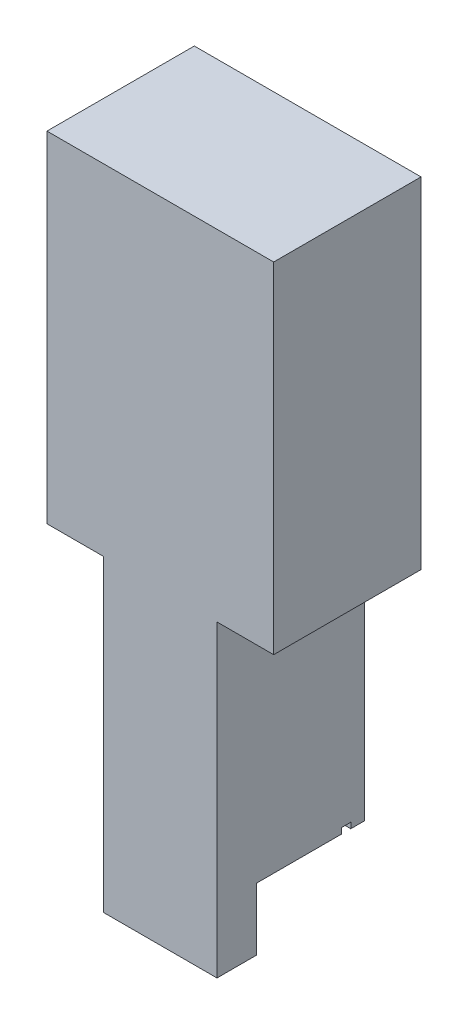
ISO-10303-21;
HEADER;
FILE_DESCRIPTION(('STEP AP214'),'2;1');
FILE_NAME('part.step','',(''),(''),'','','');
FILE_SCHEMA(('AUTOMOTIVE_DESIGN { 1 0 10303 214 1 1 1 1 }'));
ENDSEC;
DATA;
#1=APPLICATION_CONTEXT('core data for automotive mechanical design processes');
#2=APPLICATION_PROTOCOL_DEFINITION('international standard','automotive_design',2000,#1);
#3=PRODUCT_CONTEXT('',#1,'mechanical');
#4=PRODUCT('Part','Part','',(#3));
#5=PRODUCT_RELATED_PRODUCT_CATEGORY('part','',(#4));
#6=PRODUCT_DEFINITION_FORMATION('','',#4);
#7=PRODUCT_DEFINITION_CONTEXT('part definition',#1,'design');
#8=PRODUCT_DEFINITION('design','',#6,#7);
#9=PRODUCT_DEFINITION_SHAPE('','',#8);
#10=(LENGTH_UNIT() NAMED_UNIT(*) SI_UNIT(.MILLI.,.METRE.));
#11=(NAMED_UNIT(*) PLANE_ANGLE_UNIT() SI_UNIT($,.RADIAN.));
#12=(NAMED_UNIT(*) SI_UNIT($,.STERADIAN.) SOLID_ANGLE_UNIT());
#13=UNCERTAINTY_MEASURE_WITH_UNIT(LENGTH_MEASURE(1.E-05),#10,'distance_accuracy_value','');
#14=(GEOMETRIC_REPRESENTATION_CONTEXT(3) GLOBAL_UNCERTAINTY_ASSIGNED_CONTEXT((#13)) GLOBAL_UNIT_ASSIGNED_CONTEXT((#10,
#11,#12)) REPRESENTATION_CONTEXT('',''));
#15=CARTESIAN_POINT('',(0.,0.,0.));
#16=DIRECTION('',(0.,0.,1.));
#17=DIRECTION('',(1.,0.,0.));
#18=AXIS2_PLACEMENT_3D('',#15,#16,#17);
#19=CARTESIAN_POINT('',(5.,1.13686837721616E-13,13.));
#20=DIRECTION('',(1.,0.,0.));
#21=DIRECTION('',(0.,0.,-1.));
#22=AXIS2_PLACEMENT_3D('',#19,#20,#21);
#23=PLANE('',#22);
#24=DIRECTION('',(0.,0.,-1.));
#25=VECTOR('',#24,1.);
#26=CARTESIAN_POINT('',(5.,5.49999999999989,13.));
#27=LINE('',#26,#25);
#28=CARTESIAN_POINT('',(5.,5.49999999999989,1.20000000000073));
#29=VERTEX_POINT('',#28);
#30=CARTESIAN_POINT('',(5.,5.49999999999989,0.));
#31=VERTEX_POINT('',#30);
#32=EDGE_CURVE('E48',#29,#31,#27,.T.);
#33=ORIENTED_EDGE('',*,*,#32,.F.);
#34=DIRECTION('',(0.,-1.,0.));
#35=VECTOR('',#34,1.);
#36=CARTESIAN_POINT('',(5.,1.13686837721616E-13,1.20000000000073));
#37=LINE('',#36,#35);
#38=CARTESIAN_POINT('',(5.,5.99999999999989,1.20000000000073));
#39=VERTEX_POINT('',#38);
#40=EDGE_CURVE('E140',#39,#29,#37,.T.);
#41=ORIENTED_EDGE('',*,*,#40,.F.);
#42=DIRECTION('',(0.,0.,-1.));
#43=VECTOR('',#42,1.);
#44=CARTESIAN_POINT('',(5.,5.99999999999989,13.));
#45=LINE('',#44,#43);
#46=CARTESIAN_POINT('',(5.,5.99999999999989,2.));
#47=VERTEX_POINT('',#46);
#48=EDGE_CURVE('E243',#47,#39,#45,.T.);
#49=ORIENTED_EDGE('',*,*,#48,.F.);
#50=DIRECTION('',(0.,1.,0.));
#51=VECTOR('',#50,1.);
#52=CARTESIAN_POINT('',(5.,1.13686837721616E-13,2.));
#53=LINE('',#52,#51);
#54=CARTESIAN_POINT('',(5.,5.49999999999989,2.));
#55=VERTEX_POINT('',#54);
#56=EDGE_CURVE('E202',#55,#47,#53,.T.);
#57=ORIENTED_EDGE('',*,*,#56,.F.);
#58=DIRECTION('',(0.,0.,-1.));
#59=VECTOR('',#58,1.);
#60=CARTESIAN_POINT('',(5.,5.49999999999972,13.0000000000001));
#61=LINE('',#60,#59);
#62=CARTESIAN_POINT('',(5.,5.49999999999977,9.5));
#63=VERTEX_POINT('',#62);
#64=EDGE_CURVE('E240',#63,#55,#61,.T.);
#65=ORIENTED_EDGE('',*,*,#64,.F.);
#66=DIRECTION('',(0.,1.,0.));
#67=VECTOR('',#66,1.);
#68=CARTESIAN_POINT('',(5.,1.13686837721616E-13,9.5));
#69=LINE('',#68,#67);
#70=CARTESIAN_POINT('',(5.,-1.13686837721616E-13,9.5));
#71=VERTEX_POINT('',#70);
#72=EDGE_CURVE('E228',#71,#63,#69,.T.);
#73=ORIENTED_EDGE('',*,*,#72,.F.);
#74=DIRECTION('',(0.,0.,-1.));
#75=VECTOR('',#74,1.);
#76=CARTESIAN_POINT('',(5.,1.13686837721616E-13,13.));
#77=LINE('',#76,#75);
#78=CARTESIAN_POINT('',(5.,1.13686837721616E-13,13.));
#79=VERTEX_POINT('',#78);
#80=EDGE_CURVE('E161',#79,#71,#77,.T.);
#81=ORIENTED_EDGE('',*,*,#80,.F.);
#82=DIRECTION('',(0.,-1.,0.));
#83=VECTOR('',#82,1.);
#84=CARTESIAN_POINT('',(5.,1.13686837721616E-13,13.));
#85=LINE('',#84,#83);
#86=CARTESIAN_POINT('',(5.,27.2000000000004,13.));
#87=VERTEX_POINT('',#86);
#88=EDGE_CURVE('E93',#87,#79,#85,.T.);
#89=ORIENTED_EDGE('',*,*,#88,.F.);
#90=DIRECTION('',(0.,0.,-1.));
#91=VECTOR('',#90,1.);
#92=CARTESIAN_POINT('',(5.,27.2000000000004,13.));
#93=LINE('',#92,#91);
#94=CARTESIAN_POINT('',(5.,27.2000000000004,0.));
#95=VERTEX_POINT('',#94);
#96=EDGE_CURVE('E164',#87,#95,#93,.T.);
#97=ORIENTED_EDGE('',*,*,#96,.T.);
#98=DIRECTION('',(0.,-1.,0.));
#99=VECTOR('',#98,1.);
#100=CARTESIAN_POINT('',(5.,1.13686837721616E-13,0.));
#101=LINE('',#100,#99);
#102=EDGE_CURVE('E139',#95,#31,#101,.T.);
#103=ORIENTED_EDGE('',*,*,#102,.T.);
#104=EDGE_LOOP('',(#33,#41,#49,#57,#65,#73,#81,#89,#97,#103));
#105=FACE_BOUND('',#104,.T.);
#106=ADVANCED_FACE('F33',(#105),#23,.F.);
#107=CARTESIAN_POINT('',(5.,1.13686837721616E-13,13.));
#108=DIRECTION('',(0.,1.,0.));
#109=DIRECTION('',(0.,0.,1.));
#110=AXIS2_PLACEMENT_3D('',#107,#108,#109);
#111=PLANE('',#110);
#112=DIRECTION('',(1.,0.,0.));
#113=VECTOR('',#112,1.);
#114=CARTESIAN_POINT('',(0.,-1.13686837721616E-13,9.5));
#115=LINE('',#114,#113);
#116=CARTESIAN_POINT('',(15.,-1.13686837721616E-13,9.5));
#117=VERTEX_POINT('',#116);
#118=EDGE_CURVE('E229',#71,#117,#115,.T.);
#119=ORIENTED_EDGE('',*,*,#118,.T.);
#120=DIRECTION('',(0.,0.,-1.));
#121=VECTOR('',#120,1.);
#122=CARTESIAN_POINT('',(15.,1.13686837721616E-13,13.));
#123=LINE('',#122,#121);
#124=CARTESIAN_POINT('',(15.,1.13686837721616E-13,13.));
#125=VERTEX_POINT('',#124);
#126=EDGE_CURVE('E158',#125,#117,#123,.T.);
#127=ORIENTED_EDGE('',*,*,#126,.F.);
#128=DIRECTION('',(1.,0.,0.));
#129=VECTOR('',#128,1.);
#130=CARTESIAN_POINT('',(5.,1.13686837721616E-13,13.));
#131=LINE('',#130,#129);
#132=EDGE_CURVE('E249',#79,#125,#131,.T.);
#133=ORIENTED_EDGE('',*,*,#132,.F.);
#134=ORIENTED_EDGE('',*,*,#80,.T.);
#135=EDGE_LOOP('',(#119,#127,#133,#134));
#136=FACE_BOUND('',#135,.T.);
#137=ADVANCED_FACE('F269',(#136),#111,.F.);
#138=CARTESIAN_POINT('',(15.,1.13686837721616E-13,13.));
#139=DIRECTION('',(-1.,0.,0.));
#140=DIRECTION('',(0.,0.,1.));
#141=AXIS2_PLACEMENT_3D('',#138,#139,#140);
#142=PLANE('',#141);
#143=DIRECTION('',(0.,0.,1.));
#144=VECTOR('',#143,1.);
#145=CARTESIAN_POINT('',(15.,5.49999999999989,13.));
#146=LINE('',#145,#144);
#147=CARTESIAN_POINT('',(15.,5.49999999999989,0.));
#148=VERTEX_POINT('',#147);
#149=CARTESIAN_POINT('',(15.,5.49999999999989,1.20000000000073));
#150=VERTEX_POINT('',#149);
#151=EDGE_CURVE('E234',#148,#150,#146,.T.);
#152=ORIENTED_EDGE('',*,*,#151,.F.);
#153=DIRECTION('',(0.,1.,0.));
#154=VECTOR('',#153,1.);
#155=CARTESIAN_POINT('',(15.,1.13686837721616E-13,0.));
#156=LINE('',#155,#154);
#157=CARTESIAN_POINT('',(15.,27.2000000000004,0.));
#158=VERTEX_POINT('',#157);
#159=EDGE_CURVE('E143',#148,#158,#156,.T.);
#160=ORIENTED_EDGE('',*,*,#159,.T.);
#161=DIRECTION('',(0.,0.,-1.));
#162=VECTOR('',#161,1.);
#163=CARTESIAN_POINT('',(15.,27.2000000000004,13.));
#164=LINE('',#163,#162);
#165=CARTESIAN_POINT('',(15.,27.2000000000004,13.));
#166=VERTEX_POINT('',#165);
#167=EDGE_CURVE('E155',#166,#158,#164,.T.);
#168=ORIENTED_EDGE('',*,*,#167,.F.);
#169=DIRECTION('',(0.,1.,0.));
#170=VECTOR('',#169,1.);
#171=CARTESIAN_POINT('',(15.,1.13686837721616E-13,13.));
#172=LINE('',#171,#170);
#173=EDGE_CURVE('E251',#125,#166,#172,.T.);
#174=ORIENTED_EDGE('',*,*,#173,.F.);
#175=ORIENTED_EDGE('',*,*,#126,.T.);
#176=DIRECTION('',(0.,-1.,0.));
#177=VECTOR('',#176,1.);
#178=CARTESIAN_POINT('',(15.,1.13686837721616E-13,9.5));
#179=LINE('',#178,#177);
#180=CARTESIAN_POINT('',(15.,5.49999999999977,9.5));
#181=VERTEX_POINT('',#180);
#182=EDGE_CURVE('E168',#181,#117,#179,.T.);
#183=ORIENTED_EDGE('',*,*,#182,.F.);
#184=DIRECTION('',(0.,0.,1.));
#185=VECTOR('',#184,1.);
#186=CARTESIAN_POINT('',(15.,5.49999999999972,13.0000000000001));
#187=LINE('',#186,#185);
#188=CARTESIAN_POINT('',(15.,5.49999999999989,2.));
#189=VERTEX_POINT('',#188);
#190=EDGE_CURVE('E171',#189,#181,#187,.T.);
#191=ORIENTED_EDGE('',*,*,#190,.F.);
#192=DIRECTION('',(0.,-1.,0.));
#193=VECTOR('',#192,1.);
#194=CARTESIAN_POINT('',(15.,1.13686837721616E-13,2.));
#195=LINE('',#194,#193);
#196=CARTESIAN_POINT('',(15.,5.99999999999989,2.));
#197=VERTEX_POINT('',#196);
#198=EDGE_CURVE('E174',#197,#189,#195,.T.);
#199=ORIENTED_EDGE('',*,*,#198,.F.);
#200=DIRECTION('',(0.,0.,1.));
#201=VECTOR('',#200,1.);
#202=CARTESIAN_POINT('',(15.,5.99999999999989,13.));
#203=LINE('',#202,#201);
#204=CARTESIAN_POINT('',(15.,5.99999999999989,1.20000000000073));
#205=VERTEX_POINT('',#204);
#206=EDGE_CURVE('E41',#205,#197,#203,.T.);
#207=ORIENTED_EDGE('',*,*,#206,.F.);
#208=DIRECTION('',(0.,1.,0.));
#209=VECTOR('',#208,1.);
#210=CARTESIAN_POINT('',(15.,1.13686837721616E-13,1.20000000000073));
#211=LINE('',#210,#209);
#212=EDGE_CURVE('E12',#150,#205,#211,.T.);
#213=ORIENTED_EDGE('',*,*,#212,.F.);
#214=EDGE_LOOP('',(#152,#160,#168,#174,#175,#183,#191,#199,#207,#213));
#215=FACE_BOUND('',#214,.T.);
#216=ADVANCED_FACE('F207',(#215),#142,.F.);
#217=CARTESIAN_POINT('',(5.,27.2000000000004,0.));
#218=DIRECTION('',(0.,0.,1.));
#219=DIRECTION('',(1.,0.,0.));
#220=AXIS2_PLACEMENT_3D('',#217,#218,#219);
#221=PLANE('',#220);
#222=DIRECTION('',(1.,0.,0.));
#223=VECTOR('',#222,1.);
#224=CARTESIAN_POINT('',(5.,5.49999999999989,0.));
#225=LINE('',#224,#223);
#226=EDGE_CURVE('E166',#31,#148,#225,.T.);
#227=ORIENTED_EDGE('',*,*,#226,.F.);
#228=ORIENTED_EDGE('',*,*,#102,.F.);
#229=DIRECTION('',(1.,0.,0.));
#230=VECTOR('',#229,1.);
#231=CARTESIAN_POINT('',(0.,27.2000000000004,0.));
#232=LINE('',#231,#230);
#233=CARTESIAN_POINT('',(0.,27.2000000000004,0.));
#234=VERTEX_POINT('',#233);
#235=EDGE_CURVE('E136',#234,#95,#232,.T.);
#236=ORIENTED_EDGE('',*,*,#235,.F.);
#237=DIRECTION('',(0.,-1.,0.));
#238=VECTOR('',#237,1.);
#239=CARTESIAN_POINT('',(0.,27.2000000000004,0.));
#240=LINE('',#239,#238);
#241=CARTESIAN_POINT('',(0.,57.2000000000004,0.));
#242=VERTEX_POINT('',#241);
#243=EDGE_CURVE('E84',#242,#234,#240,.T.);
#244=ORIENTED_EDGE('',*,*,#243,.F.);
#245=DIRECTION('',(-1.,0.,0.));
#246=VECTOR('',#245,1.);
#247=CARTESIAN_POINT('',(0.,57.2000000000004,0.));
#248=LINE('',#247,#246);
#249=CARTESIAN_POINT('',(20.,57.2000000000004,0.));
#250=VERTEX_POINT('',#249);
#251=EDGE_CURVE('E148',#250,#242,#248,.T.);
#252=ORIENTED_EDGE('',*,*,#251,.F.);
#253=DIRECTION('',(0.,1.,0.));
#254=VECTOR('',#253,1.);
#255=CARTESIAN_POINT('',(20.,27.2000000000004,0.));
#256=LINE('',#255,#254);
#257=CARTESIAN_POINT('',(20.,27.2000000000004,0.));
#258=VERTEX_POINT('',#257);
#259=EDGE_CURVE('E124',#258,#250,#256,.T.);
#260=ORIENTED_EDGE('',*,*,#259,.F.);
#261=DIRECTION('',(1.,0.,0.));
#262=VECTOR('',#261,1.);
#263=CARTESIAN_POINT('',(15.,27.2000000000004,0.));
#264=LINE('',#263,#262);
#265=EDGE_CURVE('E145',#158,#258,#264,.T.);
#266=ORIENTED_EDGE('',*,*,#265,.F.);
#267=ORIENTED_EDGE('',*,*,#159,.F.);
#268=EDGE_LOOP('',(#227,#228,#236,#244,#252,#260,#266,#267));
#269=FACE_BOUND('',#268,.T.);
#270=ADVANCED_FACE('F261',(#269),#221,.F.);
#271=CARTESIAN_POINT('',(0.,27.2000000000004,13.));
#272=DIRECTION('',(0.,1.,0.));
#273=DIRECTION('',(0.,0.,1.));
#274=AXIS2_PLACEMENT_3D('',#271,#272,#273);
#275=PLANE('',#274);
#276=ORIENTED_EDGE('',*,*,#235,.T.);
#277=ORIENTED_EDGE('',*,*,#96,.F.);
#278=DIRECTION('',(1.,0.,0.));
#279=VECTOR('',#278,1.);
#280=CARTESIAN_POINT('',(0.,27.2000000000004,13.));
#281=LINE('',#280,#279);
#282=CARTESIAN_POINT('',(0.,27.2000000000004,13.));
#283=VERTEX_POINT('',#282);
#284=EDGE_CURVE('E151',#283,#87,#281,.T.);
#285=ORIENTED_EDGE('',*,*,#284,.F.);
#286=DIRECTION('',(0.,0.,-1.));
#287=VECTOR('',#286,1.);
#288=CARTESIAN_POINT('',(0.,27.2000000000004,13.));
#289=LINE('',#288,#287);
#290=EDGE_CURVE('E132',#283,#234,#289,.T.);
#291=ORIENTED_EDGE('',*,*,#290,.T.);
#292=EDGE_LOOP('',(#276,#277,#285,#291));
#293=FACE_BOUND('',#292,.T.);
#294=ADVANCED_FACE('F35',(#293),#275,.F.);
#295=CARTESIAN_POINT('',(15.,27.2000000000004,13.));
#296=DIRECTION('',(0.,1.,0.));
#297=DIRECTION('',(0.,0.,1.));
#298=AXIS2_PLACEMENT_3D('',#295,#296,#297);
#299=PLANE('',#298);
#300=ORIENTED_EDGE('',*,*,#265,.T.);
#301=DIRECTION('',(0.,0.,-1.));
#302=VECTOR('',#301,1.);
#303=CARTESIAN_POINT('',(20.,27.2000000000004,13.));
#304=LINE('',#303,#302);
#305=CARTESIAN_POINT('',(20.,27.2000000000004,13.));
#306=VERTEX_POINT('',#305);
#307=EDGE_CURVE('E127',#306,#258,#304,.T.);
#308=ORIENTED_EDGE('',*,*,#307,.F.);
#309=DIRECTION('',(1.,0.,0.));
#310=VECTOR('',#309,1.);
#311=CARTESIAN_POINT('',(15.,27.2000000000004,13.));
#312=LINE('',#311,#310);
#313=EDGE_CURVE('E115',#166,#306,#312,.T.);
#314=ORIENTED_EDGE('',*,*,#313,.F.);
#315=ORIENTED_EDGE('',*,*,#167,.T.);
#316=EDGE_LOOP('',(#300,#308,#314,#315));
#317=FACE_BOUND('',#316,.T.);
#318=ADVANCED_FACE('F259',(#317),#299,.F.);
#319=CARTESIAN_POINT('',(20.,27.2000000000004,13.));
#320=DIRECTION('',(-1.,0.,0.));
#321=DIRECTION('',(0.,0.,1.));
#322=AXIS2_PLACEMENT_3D('',#319,#320,#321);
#323=PLANE('',#322);
#324=ORIENTED_EDGE('',*,*,#259,.T.);
#325=DIRECTION('',(0.,0.,-1.));
#326=VECTOR('',#325,1.);
#327=CARTESIAN_POINT('',(20.,57.2000000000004,13.));
#328=LINE('',#327,#326);
#329=CARTESIAN_POINT('',(20.,57.2000000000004,13.));
#330=VERTEX_POINT('',#329);
#331=EDGE_CURVE('E121',#330,#250,#328,.T.);
#332=ORIENTED_EDGE('',*,*,#331,.F.);
#333=DIRECTION('',(0.,1.,0.));
#334=VECTOR('',#333,1.);
#335=CARTESIAN_POINT('',(20.,27.2000000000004,13.));
#336=LINE('',#335,#334);
#337=EDGE_CURVE('E108',#306,#330,#336,.T.);
#338=ORIENTED_EDGE('',*,*,#337,.F.);
#339=ORIENTED_EDGE('',*,*,#307,.T.);
#340=EDGE_LOOP('',(#324,#332,#338,#339));
#341=FACE_BOUND('',#340,.T.);
#342=ADVANCED_FACE('F122',(#341),#323,.F.);
#343=CARTESIAN_POINT('',(0.,57.2000000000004,13.));
#344=DIRECTION('',(0.,-1.,0.));
#345=DIRECTION('',(0.,0.,-1.));
#346=AXIS2_PLACEMENT_3D('',#343,#344,#345);
#347=PLANE('',#346);
#348=ORIENTED_EDGE('',*,*,#251,.T.);
#349=DIRECTION('',(0.,0.,-1.));
#350=VECTOR('',#349,1.);
#351=CARTESIAN_POINT('',(0.,57.2000000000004,13.));
#352=LINE('',#351,#350);
#353=CARTESIAN_POINT('',(0.,57.2000000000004,13.));
#354=VERTEX_POINT('',#353);
#355=EDGE_CURVE('E128',#354,#242,#352,.T.);
#356=ORIENTED_EDGE('',*,*,#355,.F.);
#357=DIRECTION('',(-1.,0.,0.));
#358=VECTOR('',#357,1.);
#359=CARTESIAN_POINT('',(0.,57.2000000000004,13.));
#360=LINE('',#359,#358);
#361=EDGE_CURVE('E112',#330,#354,#360,.T.);
#362=ORIENTED_EDGE('',*,*,#361,.F.);
#363=ORIENTED_EDGE('',*,*,#331,.T.);
#364=EDGE_LOOP('',(#348,#356,#362,#363));
#365=FACE_BOUND('',#364,.T.);
#366=ADVANCED_FACE('F130',(#365),#347,.F.);
#367=CARTESIAN_POINT('',(0.,27.2000000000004,13.));
#368=DIRECTION('',(1.,0.,0.));
#369=DIRECTION('',(0.,0.,-1.));
#370=AXIS2_PLACEMENT_3D('',#367,#368,#369);
#371=PLANE('',#370);
#372=ORIENTED_EDGE('',*,*,#243,.T.);
#373=ORIENTED_EDGE('',*,*,#290,.F.);
#374=DIRECTION('',(0.,-1.,0.));
#375=VECTOR('',#374,1.);
#376=CARTESIAN_POINT('',(0.,27.2000000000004,13.));
#377=LINE('',#376,#375);
#378=EDGE_CURVE('E57',#354,#283,#377,.T.);
#379=ORIENTED_EDGE('',*,*,#378,.F.);
#380=ORIENTED_EDGE('',*,*,#355,.T.);
#381=EDGE_LOOP('',(#372,#373,#379,#380));
#382=FACE_BOUND('',#381,.T.);
#383=ADVANCED_FACE('F263',(#382),#371,.F.);
#384=CARTESIAN_POINT('',(5.,27.2000000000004,13.));
#385=DIRECTION('',(0.,0.,1.));
#386=DIRECTION('',(1.,0.,0.));
#387=AXIS2_PLACEMENT_3D('',#384,#385,#386);
#388=PLANE('',#387);
#389=ORIENTED_EDGE('',*,*,#284,.T.);
#390=ORIENTED_EDGE('',*,*,#88,.T.);
#391=ORIENTED_EDGE('',*,*,#132,.T.);
#392=ORIENTED_EDGE('',*,*,#173,.T.);
#393=ORIENTED_EDGE('',*,*,#313,.T.);
#394=ORIENTED_EDGE('',*,*,#337,.T.);
#395=ORIENTED_EDGE('',*,*,#361,.T.);
#396=ORIENTED_EDGE('',*,*,#378,.T.);
#397=EDGE_LOOP('',(#389,#390,#391,#392,#393,#394,#395,#396));
#398=FACE_BOUND('',#397,.T.);
#399=ADVANCED_FACE('F110',(#398),#388,.T.);
#400=CARTESIAN_POINT('',(0.,5.49999999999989,1.20000000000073));
#401=DIRECTION('',(0.,0.,1.));
#402=DIRECTION('',(1.,0.,0.));
#403=AXIS2_PLACEMENT_3D('',#400,#401,#402);
#404=PLANE('',#403);
#405=ORIENTED_EDGE('',*,*,#40,.T.);
#406=DIRECTION('',(1.,0.,0.));
#407=VECTOR('',#406,1.);
#408=CARTESIAN_POINT('',(0.,5.49999999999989,1.20000000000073));
#409=LINE('',#408,#407);
#410=EDGE_CURVE('E237',#29,#150,#409,.T.);
#411=ORIENTED_EDGE('',*,*,#410,.T.);
#412=ORIENTED_EDGE('',*,*,#212,.T.);
#413=DIRECTION('',(1.,0.,0.));
#414=VECTOR('',#413,1.);
#415=CARTESIAN_POINT('',(0.,5.99999999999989,1.20000000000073));
#416=LINE('',#415,#414);
#417=EDGE_CURVE('E189',#39,#205,#416,.T.);
#418=ORIENTED_EDGE('',*,*,#417,.F.);
#419=EDGE_LOOP('',(#405,#411,#412,#418));
#420=FACE_BOUND('',#419,.T.);
#421=ADVANCED_FACE('F279',(#420),#404,.T.);
#422=CARTESIAN_POINT('',(0.,5.99999999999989,2.));
#423=DIRECTION('',(0.,-1.,0.));
#424=DIRECTION('',(0.,0.,-1.));
#425=AXIS2_PLACEMENT_3D('',#422,#423,#424);
#426=PLANE('',#425);
#427=ORIENTED_EDGE('',*,*,#48,.T.);
#428=ORIENTED_EDGE('',*,*,#417,.T.);
#429=ORIENTED_EDGE('',*,*,#206,.T.);
#430=DIRECTION('',(1.,0.,0.));
#431=VECTOR('',#430,1.);
#432=CARTESIAN_POINT('',(0.,5.99999999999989,2.));
#433=LINE('',#432,#431);
#434=EDGE_CURVE('E186',#47,#197,#433,.T.);
#435=ORIENTED_EDGE('',*,*,#434,.F.);
#436=EDGE_LOOP('',(#427,#428,#429,#435));
#437=FACE_BOUND('',#436,.T.);
#438=ADVANCED_FACE('F184',(#437),#426,.T.);
#439=CARTESIAN_POINT('',(0.,5.49999999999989,2.));
#440=DIRECTION('',(0.,0.,-1.));
#441=DIRECTION('',(-1.,0.,0.));
#442=AXIS2_PLACEMENT_3D('',#439,#440,#441);
#443=PLANE('',#442);
#444=ORIENTED_EDGE('',*,*,#56,.T.);
#445=ORIENTED_EDGE('',*,*,#434,.T.);
#446=ORIENTED_EDGE('',*,*,#198,.T.);
#447=DIRECTION('',(1.,0.,0.));
#448=VECTOR('',#447,1.);
#449=CARTESIAN_POINT('',(0.,5.49999999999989,2.));
#450=LINE('',#449,#448);
#451=EDGE_CURVE('E203',#55,#189,#450,.T.);
#452=ORIENTED_EDGE('',*,*,#451,.F.);
#453=EDGE_LOOP('',(#444,#445,#446,#452));
#454=FACE_BOUND('',#453,.T.);
#455=ADVANCED_FACE('F197',(#454),#443,.T.);
#456=CARTESIAN_POINT('',(0.,5.49999999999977,9.5));
#457=DIRECTION('',(0.,-1.,0.));
#458=DIRECTION('',(0.,0.,-1.));
#459=AXIS2_PLACEMENT_3D('',#456,#457,#458);
#460=PLANE('',#459);
#461=ORIENTED_EDGE('',*,*,#64,.T.);
#462=ORIENTED_EDGE('',*,*,#451,.T.);
#463=ORIENTED_EDGE('',*,*,#190,.T.);
#464=DIRECTION('',(1.,0.,0.));
#465=VECTOR('',#464,1.);
#466=CARTESIAN_POINT('',(0.,5.49999999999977,9.5));
#467=LINE('',#466,#465);
#468=EDGE_CURVE('E218',#63,#181,#467,.T.);
#469=ORIENTED_EDGE('',*,*,#468,.F.);
#470=EDGE_LOOP('',(#461,#462,#463,#469));
#471=FACE_BOUND('',#470,.T.);
#472=ADVANCED_FACE('F216',(#471),#460,.T.);
#473=CARTESIAN_POINT('',(0.,-1.13686837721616E-13,9.5));
#474=DIRECTION('',(0.,0.,-1.));
#475=DIRECTION('',(-1.,0.,0.));
#476=AXIS2_PLACEMENT_3D('',#473,#474,#475);
#477=PLANE('',#476);
#478=ORIENTED_EDGE('',*,*,#72,.T.);
#479=ORIENTED_EDGE('',*,*,#468,.T.);
#480=ORIENTED_EDGE('',*,*,#182,.T.);
#481=ORIENTED_EDGE('',*,*,#118,.F.);
#482=EDGE_LOOP('',(#478,#479,#480,#481));
#483=FACE_BOUND('',#482,.T.);
#484=ADVANCED_FACE('F223',(#483),#477,.T.);
#485=CARTESIAN_POINT('',(0.,5.49999999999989,1.20000000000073));
#486=DIRECTION('',(0.,-1.,0.));
#487=DIRECTION('',(0.,0.,-1.));
#488=AXIS2_PLACEMENT_3D('',#485,#486,#487);
#489=PLANE('',#488);
#490=ORIENTED_EDGE('',*,*,#32,.T.);
#491=ORIENTED_EDGE('',*,*,#226,.T.);
#492=ORIENTED_EDGE('',*,*,#151,.T.);
#493=ORIENTED_EDGE('',*,*,#410,.F.);
#494=EDGE_LOOP('',(#490,#491,#492,#493));
#495=FACE_BOUND('',#494,.T.);
#496=ADVANCED_FACE('F285',(#495),#489,.T.);
#497=CLOSED_SHELL('',(#106,#137,#216,#270,#294,#318,#342,#366,#383,#399,#421,#438,#455,#472,
#484,#496));
#498=MANIFOLD_SOLID_BREP('B2',#497);
#499=ADVANCED_BREP_SHAPE_REPRESENTATION('',(#18,#498),#14);
#500=SHAPE_DEFINITION_REPRESENTATION(#9,#499);
ENDSEC;
END-ISO-10303-21;
